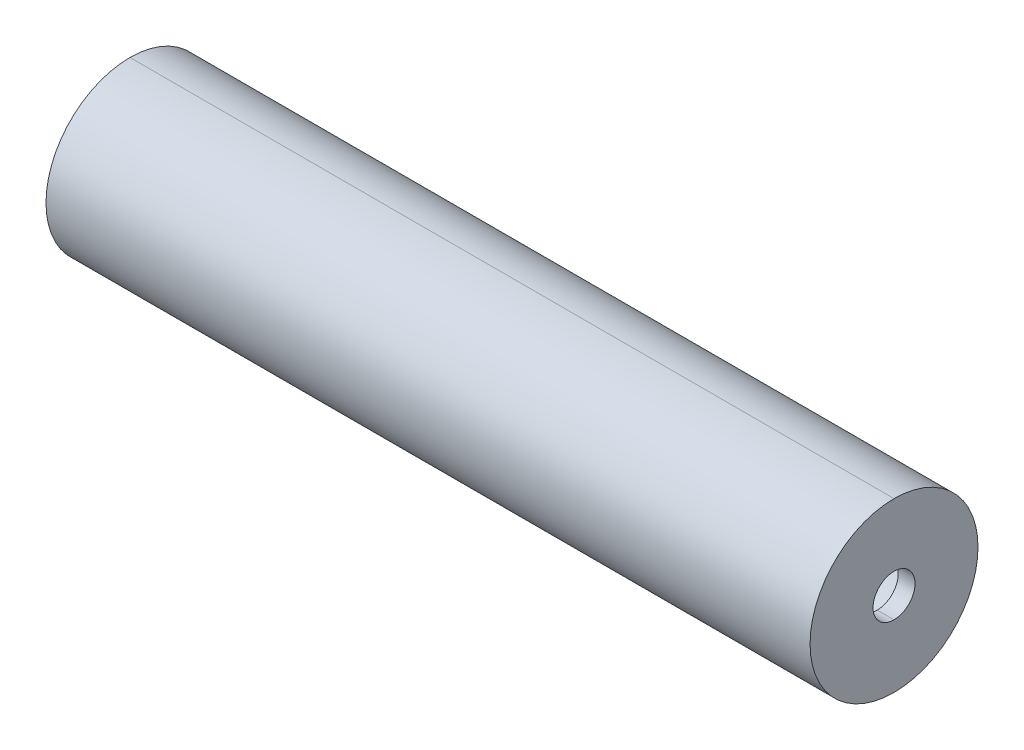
ISO-10303-21;
HEADER;
FILE_DESCRIPTION(('STEP AP214'),'2;1');
FILE_NAME('part.step','',(''),(''),'','','');
FILE_SCHEMA(('AUTOMOTIVE_DESIGN { 1 0 10303 214 1 1 1 1 }'));
ENDSEC;
DATA;
#1=APPLICATION_CONTEXT('core data for automotive mechanical design processes');
#2=APPLICATION_PROTOCOL_DEFINITION('international standard','automotive_design',2000,#1);
#3=PRODUCT_CONTEXT('',#1,'mechanical');
#4=PRODUCT('Part','Part','',(#3));
#5=PRODUCT_RELATED_PRODUCT_CATEGORY('part','',(#4));
#6=PRODUCT_DEFINITION_FORMATION('','',#4);
#7=PRODUCT_DEFINITION_CONTEXT('part definition',#1,'design');
#8=PRODUCT_DEFINITION('design','',#6,#7);
#9=PRODUCT_DEFINITION_SHAPE('','',#8);
#10=(LENGTH_UNIT() NAMED_UNIT(*) SI_UNIT(.MILLI.,.METRE.));
#11=(NAMED_UNIT(*) PLANE_ANGLE_UNIT() SI_UNIT($,.RADIAN.));
#12=(NAMED_UNIT(*) SI_UNIT($,.STERADIAN.) SOLID_ANGLE_UNIT());
#13=UNCERTAINTY_MEASURE_WITH_UNIT(LENGTH_MEASURE(1.E-05),#10,'distance_accuracy_value','');
#14=(GEOMETRIC_REPRESENTATION_CONTEXT(3) GLOBAL_UNCERTAINTY_ASSIGNED_CONTEXT((#13)) GLOBAL_UNIT_ASSIGNED_CONTEXT((#10,
#11,#12)) REPRESENTATION_CONTEXT('',''));
#15=CARTESIAN_POINT('',(0.,0.,0.));
#16=DIRECTION('',(0.,0.,1.));
#17=DIRECTION('',(1.,0.,0.));
#18=AXIS2_PLACEMENT_3D('',#15,#16,#17);
#19=CARTESIAN_POINT('',(-45.5,2.5,0.));
#20=DIRECTION('',(1.,0.,0.));
#21=DIRECTION('',(0.,1.,0.));
#22=AXIS2_PLACEMENT_3D('',#19,#20,#21);
#23=PLANE('',#22);
#24=CARTESIAN_POINT('',(-45.5,0.,0.));
#25=DIRECTION('',(-1.,0.,0.));
#26=DIRECTION('',(0.,-1.,0.));
#27=AXIS2_PLACEMENT_3D('',#24,#25,#26);
#28=CIRCLE('',#27,2.5);
#29=CARTESIAN_POINT('',(-45.5,-2.5,0.));
#30=VERTEX_POINT('',#29);
#31=CARTESIAN_POINT('',(-45.5,2.5,0.));
#32=VERTEX_POINT('',#31);
#33=EDGE_CURVE('E11',#30,#32,#28,.T.);
#34=ORIENTED_EDGE('',*,*,#33,.F.);
#35=CARTESIAN_POINT('',(-45.5,0.,0.));
#36=DIRECTION('',(-1.,0.,0.));
#37=DIRECTION('',(0.,-1.,0.));
#38=AXIS2_PLACEMENT_3D('',#35,#36,#37);
#39=CIRCLE('',#38,2.5);
#40=EDGE_CURVE('E142',#32,#30,#39,.T.);
#41=ORIENTED_EDGE('',*,*,#40,.F.);
#42=EDGE_LOOP('',(#34,#41));
#43=FACE_BOUND('',#42,.T.);
#44=CARTESIAN_POINT('',(-45.5,0.,0.));
#45=DIRECTION('',(-1.,0.,0.));
#46=DIRECTION('',(0.,-1.,0.));
#47=AXIS2_PLACEMENT_3D('',#44,#45,#46);
#48=CIRCLE('',#47,10.);
#49=CARTESIAN_POINT('',(-45.5,-10.,0.));
#50=VERTEX_POINT('',#49);
#51=CARTESIAN_POINT('',(-45.5,10.,0.));
#52=VERTEX_POINT('',#51);
#53=EDGE_CURVE('E155',#50,#52,#48,.T.);
#54=ORIENTED_EDGE('',*,*,#53,.T.);
#55=CARTESIAN_POINT('',(-45.5,0.,0.));
#56=DIRECTION('',(-1.,0.,0.));
#57=DIRECTION('',(0.,-1.,0.));
#58=AXIS2_PLACEMENT_3D('',#55,#56,#57);
#59=CIRCLE('',#58,10.);
#60=EDGE_CURVE('E40',#52,#50,#59,.T.);
#61=ORIENTED_EDGE('',*,*,#60,.T.);
#62=EDGE_LOOP('',(#54,#61));
#63=FACE_BOUND('',#62,.T.);
#64=ADVANCED_FACE('F17',(#43,#63),#23,.F.);
#65=CARTESIAN_POINT('',(-45.5,0.,0.));
#66=DIRECTION('',(-1.,0.,0.));
#67=DIRECTION('',(0.,-1.,0.));
#68=AXIS2_PLACEMENT_3D('',#65,#66,#67);
#69=CYLINDRICAL_SURFACE('',#68,2.5);
#70=DIRECTION('',(-1.,0.,0.));
#71=VECTOR('',#70,1.);
#72=CARTESIAN_POINT('',(-45.5,2.5,0.));
#73=LINE('',#72,#71);
#74=CARTESIAN_POINT('',(-43.5,2.5,0.));
#75=VERTEX_POINT('',#74);
#76=EDGE_CURVE('E161',#75,#32,#73,.T.);
#77=ORIENTED_EDGE('',*,*,#76,.F.);
#78=CARTESIAN_POINT('',(-43.5,0.,0.));
#79=DIRECTION('',(-1.,0.,0.));
#80=DIRECTION('',(0.,-1.,0.));
#81=AXIS2_PLACEMENT_3D('',#78,#79,#80);
#82=CIRCLE('',#81,2.5);
#83=CARTESIAN_POINT('',(-43.5,-2.5,0.));
#84=VERTEX_POINT('',#83);
#85=EDGE_CURVE('E27',#84,#75,#82,.T.);
#86=ORIENTED_EDGE('',*,*,#85,.F.);
#87=DIRECTION('',(-1.,0.,0.));
#88=VECTOR('',#87,1.);
#89=CARTESIAN_POINT('',(-45.5,-2.5,0.));
#90=LINE('',#89,#88);
#91=EDGE_CURVE('E136',#84,#30,#90,.T.);
#92=ORIENTED_EDGE('',*,*,#91,.T.);
#93=ORIENTED_EDGE('',*,*,#33,.T.);
#94=EDGE_LOOP('',(#77,#86,#92,#93));
#95=FACE_BOUND('',#94,.T.);
#96=ADVANCED_FACE('F213',(#95),#69,.F.);
#97=CARTESIAN_POINT('',(-43.5,2.5,0.));
#98=DIRECTION('',(-1.,0.,0.));
#99=DIRECTION('',(0.,1.,0.));
#100=AXIS2_PLACEMENT_3D('',#97,#98,#99);
#101=PLANE('',#100);
#102=ORIENTED_EDGE('',*,*,#85,.T.);
#103=CARTESIAN_POINT('',(-43.5,0.,0.));
#104=DIRECTION('',(-1.,0.,0.));
#105=DIRECTION('',(0.,-1.,0.));
#106=AXIS2_PLACEMENT_3D('',#103,#104,#105);
#107=CIRCLE('',#106,2.5);
#108=EDGE_CURVE('E175',#75,#84,#107,.T.);
#109=ORIENTED_EDGE('',*,*,#108,.T.);
#110=EDGE_LOOP('',(#102,#109));
#111=FACE_BOUND('',#110,.T.);
#112=CARTESIAN_POINT('',(-43.5,0.,0.));
#113=DIRECTION('',(-1.,0.,0.));
#114=DIRECTION('',(0.,-1.,0.));
#115=AXIS2_PLACEMENT_3D('',#112,#113,#114);
#116=CIRCLE('',#115,8.);
#117=CARTESIAN_POINT('',(-43.5,-8.,0.));
#118=VERTEX_POINT('',#117);
#119=CARTESIAN_POINT('',(-43.5,8.,0.));
#120=VERTEX_POINT('',#119);
#121=EDGE_CURVE('E86',#118,#120,#116,.T.);
#122=ORIENTED_EDGE('',*,*,#121,.F.);
#123=CARTESIAN_POINT('',(-43.5,0.,0.));
#124=DIRECTION('',(-1.,0.,0.));
#125=DIRECTION('',(0.,-1.,0.));
#126=AXIS2_PLACEMENT_3D('',#123,#124,#125);
#127=CIRCLE('',#126,8.);
#128=EDGE_CURVE('E131',#120,#118,#127,.T.);
#129=ORIENTED_EDGE('',*,*,#128,.F.);
#130=EDGE_LOOP('',(#122,#129));
#131=FACE_BOUND('',#130,.T.);
#132=ADVANCED_FACE('F209',(#111,#131),#101,.F.);
#133=CARTESIAN_POINT('',(-45.5,0.,0.));
#134=DIRECTION('',(-1.,0.,0.));
#135=DIRECTION('',(0.,-1.,0.));
#136=AXIS2_PLACEMENT_3D('',#133,#134,#135);
#137=CYLINDRICAL_SURFACE('',#136,8.);
#138=DIRECTION('',(-1.,0.,0.));
#139=VECTOR('',#138,1.);
#140=CARTESIAN_POINT('',(-45.5,8.,0.));
#141=LINE('',#140,#139);
#142=CARTESIAN_POINT('',(43.5,8.,0.));
#143=VERTEX_POINT('',#142);
#144=EDGE_CURVE('E126',#143,#120,#141,.T.);
#145=ORIENTED_EDGE('',*,*,#144,.F.);
#146=CARTESIAN_POINT('',(43.5,0.,0.));
#147=DIRECTION('',(-1.,0.,0.));
#148=DIRECTION('',(0.,-1.,0.));
#149=AXIS2_PLACEMENT_3D('',#146,#147,#148);
#150=CIRCLE('',#149,8.);
#151=CARTESIAN_POINT('',(43.5,-8.,0.));
#152=VERTEX_POINT('',#151);
#153=EDGE_CURVE('E117',#152,#143,#150,.T.);
#154=ORIENTED_EDGE('',*,*,#153,.F.);
#155=DIRECTION('',(-1.,0.,0.));
#156=VECTOR('',#155,1.);
#157=CARTESIAN_POINT('',(-45.5,-8.,0.));
#158=LINE('',#157,#156);
#159=EDGE_CURVE('E134',#152,#118,#158,.T.);
#160=ORIENTED_EDGE('',*,*,#159,.T.);
#161=ORIENTED_EDGE('',*,*,#121,.T.);
#162=EDGE_LOOP('',(#145,#154,#160,#161));
#163=FACE_BOUND('',#162,.T.);
#164=ADVANCED_FACE('F127',(#163),#137,.F.);
#165=CARTESIAN_POINT('',(43.5,8.,0.));
#166=DIRECTION('',(1.,0.,0.));
#167=DIRECTION('',(0.,1.,0.));
#168=AXIS2_PLACEMENT_3D('',#165,#166,#167);
#169=PLANE('',#168);
#170=CARTESIAN_POINT('',(43.5,0.,0.));
#171=DIRECTION('',(-1.,0.,0.));
#172=DIRECTION('',(0.,-1.,0.));
#173=AXIS2_PLACEMENT_3D('',#170,#171,#172);
#174=CIRCLE('',#173,2.5);
#175=CARTESIAN_POINT('',(43.5,-2.5,0.));
#176=VERTEX_POINT('',#175);
#177=CARTESIAN_POINT('',(43.5,2.5,0.));
#178=VERTEX_POINT('',#177);
#179=EDGE_CURVE('E20',#176,#178,#174,.T.);
#180=ORIENTED_EDGE('',*,*,#179,.F.);
#181=CARTESIAN_POINT('',(43.5,0.,0.));
#182=DIRECTION('',(-1.,0.,0.));
#183=DIRECTION('',(0.,-1.,0.));
#184=AXIS2_PLACEMENT_3D('',#181,#182,#183);
#185=CIRCLE('',#184,2.5);
#186=EDGE_CURVE('E167',#178,#176,#185,.T.);
#187=ORIENTED_EDGE('',*,*,#186,.F.);
#188=EDGE_LOOP('',(#180,#187));
#189=FACE_BOUND('',#188,.T.);
#190=ORIENTED_EDGE('',*,*,#153,.T.);
#191=CARTESIAN_POINT('',(43.5,0.,0.));
#192=DIRECTION('',(-1.,0.,0.));
#193=DIRECTION('',(0.,-1.,0.));
#194=AXIS2_PLACEMENT_3D('',#191,#192,#193);
#195=CIRCLE('',#194,8.);
#196=EDGE_CURVE('E121',#143,#152,#195,.T.);
#197=ORIENTED_EDGE('',*,*,#196,.T.);
#198=EDGE_LOOP('',(#190,#197));
#199=FACE_BOUND('',#198,.T.);
#200=ADVANCED_FACE('F119',(#189,#199),#169,.F.);
#201=CARTESIAN_POINT('',(-45.5,0.,0.));
#202=DIRECTION('',(-1.,0.,0.));
#203=DIRECTION('',(0.,-1.,0.));
#204=AXIS2_PLACEMENT_3D('',#201,#202,#203);
#205=CYLINDRICAL_SURFACE('',#204,2.5);
#206=DIRECTION('',(-1.,0.,0.));
#207=VECTOR('',#206,1.);
#208=CARTESIAN_POINT('',(-45.5,2.5,0.));
#209=LINE('',#208,#207);
#210=CARTESIAN_POINT('',(45.5,2.5,0.));
#211=VERTEX_POINT('',#210);
#212=EDGE_CURVE('E191',#211,#178,#209,.T.);
#213=ORIENTED_EDGE('',*,*,#212,.F.);
#214=CARTESIAN_POINT('',(45.5,0.,0.));
#215=DIRECTION('',(-1.,0.,0.));
#216=DIRECTION('',(0.,-1.,0.));
#217=AXIS2_PLACEMENT_3D('',#214,#215,#216);
#218=CIRCLE('',#217,2.5);
#219=CARTESIAN_POINT('',(45.5,-2.5,0.));
#220=VERTEX_POINT('',#219);
#221=EDGE_CURVE('E75',#220,#211,#218,.T.);
#222=ORIENTED_EDGE('',*,*,#221,.F.);
#223=DIRECTION('',(-1.,0.,0.));
#224=VECTOR('',#223,1.);
#225=CARTESIAN_POINT('',(-45.5,-2.5,0.));
#226=LINE('',#225,#224);
#227=EDGE_CURVE('E162',#220,#176,#226,.T.);
#228=ORIENTED_EDGE('',*,*,#227,.T.);
#229=ORIENTED_EDGE('',*,*,#179,.T.);
#230=EDGE_LOOP('',(#213,#222,#228,#229));
#231=FACE_BOUND('',#230,.T.);
#232=ADVANCED_FACE('F228',(#231),#205,.F.);
#233=CARTESIAN_POINT('',(45.5,10.,0.));
#234=DIRECTION('',(-1.,0.,0.));
#235=DIRECTION('',(0.,1.,0.));
#236=AXIS2_PLACEMENT_3D('',#233,#234,#235);
#237=PLANE('',#236);
#238=ORIENTED_EDGE('',*,*,#221,.T.);
#239=CARTESIAN_POINT('',(45.5,0.,0.));
#240=DIRECTION('',(-1.,0.,0.));
#241=DIRECTION('',(0.,-1.,0.));
#242=AXIS2_PLACEMENT_3D('',#239,#240,#241);
#243=CIRCLE('',#242,2.5);
#244=EDGE_CURVE('E150',#211,#220,#243,.T.);
#245=ORIENTED_EDGE('',*,*,#244,.T.);
#246=EDGE_LOOP('',(#238,#245));
#247=FACE_BOUND('',#246,.T.);
#248=CARTESIAN_POINT('',(45.5,0.,0.));
#249=DIRECTION('',(-1.,0.,0.));
#250=DIRECTION('',(0.,-1.,0.));
#251=AXIS2_PLACEMENT_3D('',#248,#249,#250);
#252=CIRCLE('',#251,10.);
#253=CARTESIAN_POINT('',(45.5,-10.,0.));
#254=VERTEX_POINT('',#253);
#255=CARTESIAN_POINT('',(45.5,10.,0.));
#256=VERTEX_POINT('',#255);
#257=EDGE_CURVE('E166',#254,#256,#252,.T.);
#258=ORIENTED_EDGE('',*,*,#257,.F.);
#259=CARTESIAN_POINT('',(45.5,0.,0.));
#260=DIRECTION('',(-1.,0.,0.));
#261=DIRECTION('',(0.,-1.,0.));
#262=AXIS2_PLACEMENT_3D('',#259,#260,#261);
#263=CIRCLE('',#262,10.);
#264=EDGE_CURVE('E154',#256,#254,#263,.T.);
#265=ORIENTED_EDGE('',*,*,#264,.F.);
#266=EDGE_LOOP('',(#258,#265));
#267=FACE_BOUND('',#266,.T.);
#268=ADVANCED_FACE('F226',(#247,#267),#237,.F.);
#269=CARTESIAN_POINT('',(-45.5,0.,0.));
#270=DIRECTION('',(-1.,0.,0.));
#271=DIRECTION('',(0.,-1.,0.));
#272=AXIS2_PLACEMENT_3D('',#269,#270,#271);
#273=CYLINDRICAL_SURFACE('',#272,10.);
#274=DIRECTION('',(-1.,0.,0.));
#275=VECTOR('',#274,1.);
#276=CARTESIAN_POINT('',(-45.5,10.,0.));
#277=LINE('',#276,#275);
#278=EDGE_CURVE('E170',#256,#52,#277,.T.);
#279=ORIENTED_EDGE('',*,*,#278,.F.);
#280=ORIENTED_EDGE('',*,*,#264,.T.);
#281=DIRECTION('',(-1.,0.,0.));
#282=VECTOR('',#281,1.);
#283=CARTESIAN_POINT('',(-45.5,-10.,0.));
#284=LINE('',#283,#282);
#285=EDGE_CURVE('E151',#254,#50,#284,.T.);
#286=ORIENTED_EDGE('',*,*,#285,.T.);
#287=ORIENTED_EDGE('',*,*,#60,.F.);
#288=EDGE_LOOP('',(#279,#280,#286,#287));
#289=FACE_BOUND('',#288,.T.);
#290=ADVANCED_FACE('F224',(#289),#273,.T.);
#291=CARTESIAN_POINT('',(-45.5,0.,0.));
#292=DIRECTION('',(-1.,0.,0.));
#293=DIRECTION('',(0.,-1.,0.));
#294=AXIS2_PLACEMENT_3D('',#291,#292,#293);
#295=CYLINDRICAL_SURFACE('',#294,10.);
#296=ORIENTED_EDGE('',*,*,#257,.T.);
#297=ORIENTED_EDGE('',*,*,#278,.T.);
#298=ORIENTED_EDGE('',*,*,#53,.F.);
#299=ORIENTED_EDGE('',*,*,#285,.F.);
#300=EDGE_LOOP('',(#296,#297,#298,#299));
#301=FACE_BOUND('',#300,.T.);
#302=ADVANCED_FACE('F221',(#301),#295,.T.);
#303=CARTESIAN_POINT('',(-45.5,0.,0.));
#304=DIRECTION('',(-1.,0.,0.));
#305=DIRECTION('',(0.,-1.,0.));
#306=AXIS2_PLACEMENT_3D('',#303,#304,#305);
#307=CYLINDRICAL_SURFACE('',#306,2.5);
#308=ORIENTED_EDGE('',*,*,#244,.F.);
#309=ORIENTED_EDGE('',*,*,#212,.T.);
#310=ORIENTED_EDGE('',*,*,#186,.T.);
#311=ORIENTED_EDGE('',*,*,#227,.F.);
#312=EDGE_LOOP('',(#308,#309,#310,#311));
#313=FACE_BOUND('',#312,.T.);
#314=ADVANCED_FACE('F241',(#313),#307,.F.);
#315=CARTESIAN_POINT('',(-45.5,0.,0.));
#316=DIRECTION('',(-1.,0.,0.));
#317=DIRECTION('',(0.,-1.,0.));
#318=AXIS2_PLACEMENT_3D('',#315,#316,#317);
#319=CYLINDRICAL_SURFACE('',#318,8.);
#320=ORIENTED_EDGE('',*,*,#196,.F.);
#321=ORIENTED_EDGE('',*,*,#144,.T.);
#322=ORIENTED_EDGE('',*,*,#128,.T.);
#323=ORIENTED_EDGE('',*,*,#159,.F.);
#324=EDGE_LOOP('',(#320,#321,#322,#323));
#325=FACE_BOUND('',#324,.T.);
#326=ADVANCED_FACE('F133',(#325),#319,.F.);
#327=CARTESIAN_POINT('',(-45.5,0.,0.));
#328=DIRECTION('',(-1.,0.,0.));
#329=DIRECTION('',(0.,-1.,0.));
#330=AXIS2_PLACEMENT_3D('',#327,#328,#329);
#331=CYLINDRICAL_SURFACE('',#330,2.5);
#332=ORIENTED_EDGE('',*,*,#108,.F.);
#333=ORIENTED_EDGE('',*,*,#76,.T.);
#334=ORIENTED_EDGE('',*,*,#40,.T.);
#335=ORIENTED_EDGE('',*,*,#91,.F.);
#336=EDGE_LOOP('',(#332,#333,#334,#335));
#337=FACE_BOUND('',#336,.T.);
#338=ADVANCED_FACE('F215',(#337),#331,.F.);
#339=CLOSED_SHELL('',(#64,#96,#132,#164,#200,#232,#268,#290,#302,#314,#326,#338));
#340=MANIFOLD_SOLID_BREP('B1',#339);
#341=ADVANCED_BREP_SHAPE_REPRESENTATION('',(#18,#340),#14);
#342=SHAPE_DEFINITION_REPRESENTATION(#9,#341);
ENDSEC;
END-ISO-10303-21;
